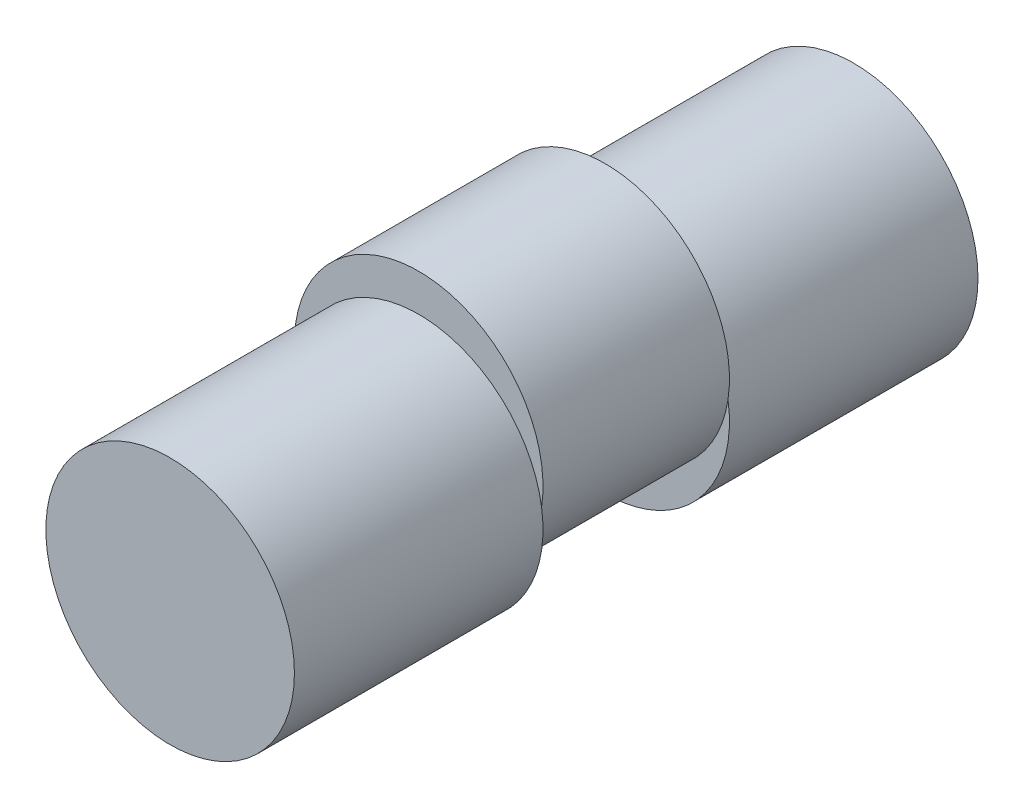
ISO-10303-21;
HEADER;
FILE_DESCRIPTION(('STEP AP214'),'2;1');
FILE_NAME('part.step','',(''),(''),'','','');
FILE_SCHEMA(('AUTOMOTIVE_DESIGN { 1 0 10303 214 1 1 1 1 }'));
ENDSEC;
DATA;
#1=APPLICATION_CONTEXT('core data for automotive mechanical design processes');
#2=APPLICATION_PROTOCOL_DEFINITION('international standard','automotive_design',2000,#1);
#3=PRODUCT_CONTEXT('',#1,'mechanical');
#4=PRODUCT('Part','Part','',(#3));
#5=PRODUCT_RELATED_PRODUCT_CATEGORY('part','',(#4));
#6=PRODUCT_DEFINITION_FORMATION('','',#4);
#7=PRODUCT_DEFINITION_CONTEXT('part definition',#1,'design');
#8=PRODUCT_DEFINITION('design','',#6,#7);
#9=PRODUCT_DEFINITION_SHAPE('','',#8);
#10=(LENGTH_UNIT() NAMED_UNIT(*) SI_UNIT(.MILLI.,.METRE.));
#11=(NAMED_UNIT(*) PLANE_ANGLE_UNIT() SI_UNIT($,.RADIAN.));
#12=(NAMED_UNIT(*) SI_UNIT($,.STERADIAN.) SOLID_ANGLE_UNIT());
#13=UNCERTAINTY_MEASURE_WITH_UNIT(LENGTH_MEASURE(1.E-05),#10,'distance_accuracy_value','');
#14=(GEOMETRIC_REPRESENTATION_CONTEXT(3) GLOBAL_UNCERTAINTY_ASSIGNED_CONTEXT((#13)) GLOBAL_UNIT_ASSIGNED_CONTEXT((#10,
#11,#12)) REPRESENTATION_CONTEXT('',''));
#15=CARTESIAN_POINT('',(0.,0.,0.));
#16=DIRECTION('',(0.,0.,1.));
#17=DIRECTION('',(1.,0.,0.));
#18=AXIS2_PLACEMENT_3D('',#15,#16,#17);
#19=CARTESIAN_POINT('',(0.,0.,20.));
#20=DIRECTION('',(0.,0.,-1.));
#21=DIRECTION('',(-1.,0.,0.));
#22=AXIS2_PLACEMENT_3D('',#19,#20,#21);
#23=CYLINDRICAL_SURFACE('',#22,10.);
#24=CARTESIAN_POINT('',(0.,0.,20.));
#25=DIRECTION('',(0.,0.,1.));
#26=DIRECTION('',(1.,0.,0.));
#27=AXIS2_PLACEMENT_3D('',#24,#25,#26);
#28=CIRCLE('',#27,10.);
#29=CARTESIAN_POINT('',(9.8868599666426,1.50000000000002,20.));
#30=VERTEX_POINT('',#29);
#31=CARTESIAN_POINT('',(-9.8868599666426,1.50000000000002,20.));
#32=VERTEX_POINT('',#31);
#33=EDGE_CURVE('E11',#30,#32,#28,.T.);
#34=ORIENTED_EDGE('',*,*,#33,.F.);
#35=EDGE_CURVE('E47',#32,#30,#28,.T.);
#36=ORIENTED_EDGE('',*,*,#35,.F.);
#37=EDGE_LOOP('',(#34,#36));
#38=FACE_BOUND('',#37,.T.);
#39=CARTESIAN_POINT('',(0.,0.,0.));
#40=DIRECTION('',(0.,0.,1.));
#41=DIRECTION('',(1.,0.,0.));
#42=AXIS2_PLACEMENT_3D('',#39,#40,#41);
#43=CIRCLE('',#42,10.);
#44=CARTESIAN_POINT('',(10.,0.,0.));
#45=VERTEX_POINT('',#44);
#46=EDGE_CURVE('E42',#45,#45,#43,.T.);
#47=ORIENTED_EDGE('',*,*,#46,.T.);
#48=EDGE_LOOP('',(#47));
#49=FACE_BOUND('',#48,.T.);
#50=ADVANCED_FACE('F39',(#38,#49),#23,.T.);
#51=CARTESIAN_POINT('',(0.,0.,20.));
#52=DIRECTION('',(0.,0.,1.));
#53=DIRECTION('',(1.,0.,0.));
#54=AXIS2_PLACEMENT_3D('',#51,#52,#53);
#55=PLANE('',#54);
#56=CARTESIAN_POINT('',(0.,3.,20.));
#57=DIRECTION('',(0.,0.,1.));
#58=DIRECTION('',(1.,0.,0.));
#59=AXIS2_PLACEMENT_3D('',#56,#57,#58);
#60=CIRCLE('',#59,10.);
#61=EDGE_CURVE('E60',#32,#30,#60,.T.);
#62=ORIENTED_EDGE('',*,*,#61,.F.);
#63=ORIENTED_EDGE('',*,*,#35,.T.);
#64=EDGE_LOOP('',(#62,#63));
#65=FACE_BOUND('',#64,.T.);
#66=ADVANCED_FACE('F94',(#65),#55,.T.);
#67=CARTESIAN_POINT('',(0.,0.,0.));
#68=DIRECTION('',(0.,0.,1.));
#69=DIRECTION('',(1.,0.,0.));
#70=AXIS2_PLACEMENT_3D('',#67,#68,#69);
#71=PLANE('',#70);
#72=ORIENTED_EDGE('',*,*,#46,.F.);
#73=EDGE_LOOP('',(#72));
#74=FACE_BOUND('',#73,.T.);
#75=ADVANCED_FACE('F98',(#74),#71,.F.);
#76=CARTESIAN_POINT('',(0.,3.,20.));
#77=DIRECTION('',(0.,0.,1.));
#78=DIRECTION('',(1.,0.,0.));
#79=AXIS2_PLACEMENT_3D('',#76,#77,#78);
#80=PLANE('',#79);
#81=EDGE_CURVE('E85',#30,#32,#60,.T.);
#82=ORIENTED_EDGE('',*,*,#81,.F.);
#83=ORIENTED_EDGE('',*,*,#33,.T.);
#84=EDGE_LOOP('',(#82,#83));
#85=FACE_BOUND('',#84,.T.);
#86=ADVANCED_FACE('F91',(#85),#80,.F.);
#87=CARTESIAN_POINT('',(0.,3.,35.));
#88=DIRECTION('',(0.,0.,-1.));
#89=DIRECTION('',(-1.,0.,0.));
#90=AXIS2_PLACEMENT_3D('',#87,#88,#89);
#91=CYLINDRICAL_SURFACE('',#90,10.);
#92=CARTESIAN_POINT('',(0.,3.,35.));
#93=DIRECTION('',(0.,0.,1.));
#94=DIRECTION('',(1.,0.,0.));
#95=AXIS2_PLACEMENT_3D('',#92,#93,#94);
#96=CIRCLE('',#95,10.);
#97=CARTESIAN_POINT('',(-9.8868599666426,1.50000000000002,35.));
#98=VERTEX_POINT('',#97);
#99=CARTESIAN_POINT('',(9.8868599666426,1.50000000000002,35.));
#100=VERTEX_POINT('',#99);
#101=EDGE_CURVE('E69',#98,#100,#96,.T.);
#102=ORIENTED_EDGE('',*,*,#101,.F.);
#103=EDGE_CURVE('E72',#100,#98,#96,.T.);
#104=ORIENTED_EDGE('',*,*,#103,.F.);
#105=EDGE_LOOP('',(#102,#104));
#106=FACE_BOUND('',#105,.T.);
#107=ORIENTED_EDGE('',*,*,#61,.T.);
#108=ORIENTED_EDGE('',*,*,#81,.T.);
#109=EDGE_LOOP('',(#107,#108));
#110=FACE_BOUND('',#109,.T.);
#111=ADVANCED_FACE('F70',(#106,#110),#91,.T.);
#112=CARTESIAN_POINT('',(0.,3.,35.));
#113=DIRECTION('',(0.,0.,1.));
#114=DIRECTION('',(1.,0.,0.));
#115=AXIS2_PLACEMENT_3D('',#112,#113,#114);
#116=PLANE('',#115);
#117=CARTESIAN_POINT('',(0.,0.,35.));
#118=DIRECTION('',(0.,0.,1.));
#119=DIRECTION('',(1.,0.,0.));
#120=AXIS2_PLACEMENT_3D('',#117,#118,#119);
#121=CIRCLE('',#120,10.);
#122=EDGE_CURVE('E53',#100,#98,#121,.T.);
#123=ORIENTED_EDGE('',*,*,#122,.F.);
#124=ORIENTED_EDGE('',*,*,#103,.T.);
#125=EDGE_LOOP('',(#123,#124));
#126=FACE_BOUND('',#125,.T.);
#127=ADVANCED_FACE('F77',(#126),#116,.T.);
#128=CARTESIAN_POINT('',(0.,0.,35.));
#129=DIRECTION('',(0.,0.,1.));
#130=DIRECTION('',(1.,0.,0.));
#131=AXIS2_PLACEMENT_3D('',#128,#129,#130);
#132=PLANE('',#131);
#133=EDGE_CURVE('E78',#98,#100,#121,.T.);
#134=ORIENTED_EDGE('',*,*,#133,.F.);
#135=ORIENTED_EDGE('',*,*,#101,.T.);
#136=EDGE_LOOP('',(#134,#135));
#137=FACE_BOUND('',#136,.T.);
#138=ADVANCED_FACE('F79',(#137),#132,.F.);
#139=CARTESIAN_POINT('',(0.,0.,55.));
#140=DIRECTION('',(0.,0.,-1.));
#141=DIRECTION('',(-1.,0.,0.));
#142=AXIS2_PLACEMENT_3D('',#139,#140,#141);
#143=CYLINDRICAL_SURFACE('',#142,10.);
#144=CARTESIAN_POINT('',(0.,0.,55.));
#145=DIRECTION('',(0.,0.,1.));
#146=DIRECTION('',(1.,0.,0.));
#147=AXIS2_PLACEMENT_3D('',#144,#145,#146);
#148=CIRCLE('',#147,10.);
#149=CARTESIAN_POINT('',(10.,0.,55.));
#150=VERTEX_POINT('',#149);
#151=EDGE_CURVE('E83',#150,#150,#148,.T.);
#152=ORIENTED_EDGE('',*,*,#151,.F.);
#153=EDGE_LOOP('',(#152));
#154=FACE_BOUND('',#153,.T.);
#155=ORIENTED_EDGE('',*,*,#122,.T.);
#156=ORIENTED_EDGE('',*,*,#133,.T.);
#157=EDGE_LOOP('',(#155,#156));
#158=FACE_BOUND('',#157,.T.);
#159=ADVANCED_FACE('F82',(#154,#158),#143,.T.);
#160=CARTESIAN_POINT('',(0.,0.,55.));
#161=DIRECTION('',(0.,0.,1.));
#162=DIRECTION('',(1.,0.,0.));
#163=AXIS2_PLACEMENT_3D('',#160,#161,#162);
#164=PLANE('',#163);
#165=ORIENTED_EDGE('',*,*,#151,.T.);
#166=EDGE_LOOP('',(#165));
#167=FACE_BOUND('',#166,.T.);
#168=ADVANCED_FACE('F155',(#167),#164,.T.);
#169=CLOSED_SHELL('',(#50,#66,#75,#86,#111,#127,#138,#159,#168));
#170=MANIFOLD_SOLID_BREP('B2',#169);
#171=ADVANCED_BREP_SHAPE_REPRESENTATION('',(#18,#170),#14);
#172=SHAPE_DEFINITION_REPRESENTATION(#9,#171);
ENDSEC;
END-ISO-10303-21;
